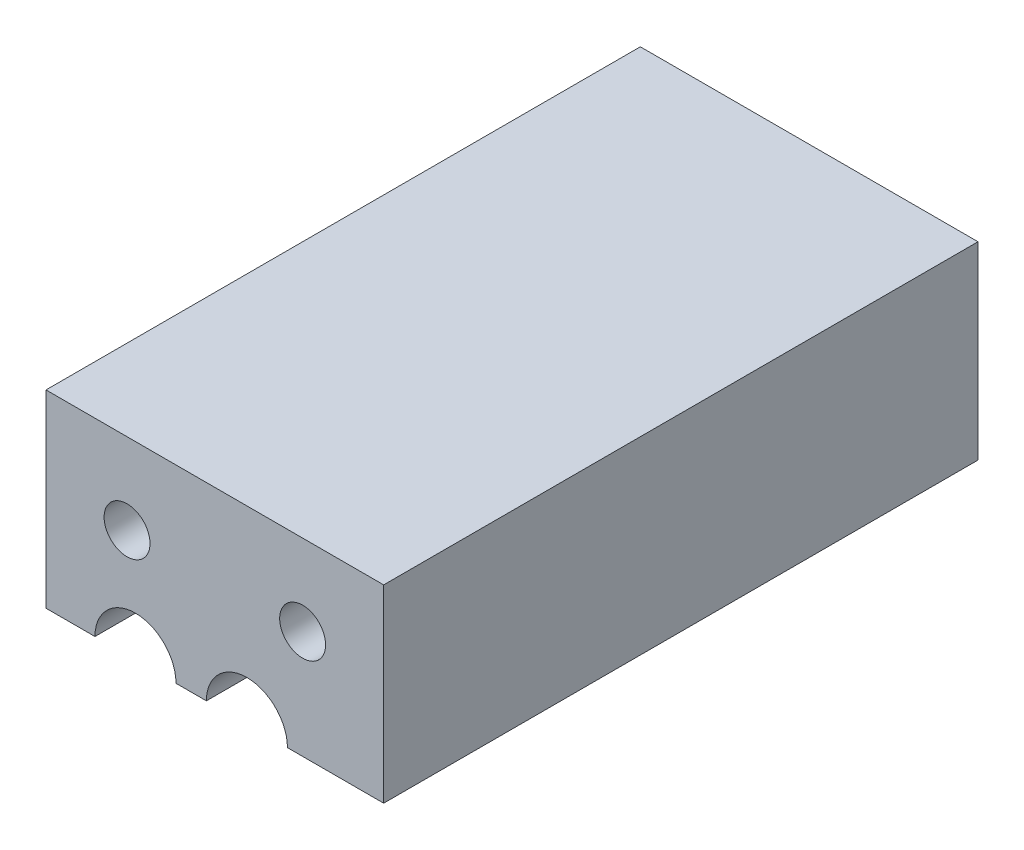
ISO-10303-21;
HEADER;
FILE_DESCRIPTION(('STEP AP214'),'2;1');
FILE_NAME('part.step','',(''),(''),'','','');
FILE_SCHEMA(('AUTOMOTIVE_DESIGN { 1 0 10303 214 1 1 1 1 }'));
ENDSEC;
DATA;
#1=APPLICATION_CONTEXT('core data for automotive mechanical design processes');
#2=APPLICATION_PROTOCOL_DEFINITION('international standard','automotive_design',2000,#1);
#3=PRODUCT_CONTEXT('',#1,'mechanical');
#4=PRODUCT('Part','Part','',(#3));
#5=PRODUCT_RELATED_PRODUCT_CATEGORY('part','',(#4));
#6=PRODUCT_DEFINITION_FORMATION('','',#4);
#7=PRODUCT_DEFINITION_CONTEXT('part definition',#1,'design');
#8=PRODUCT_DEFINITION('design','',#6,#7);
#9=PRODUCT_DEFINITION_SHAPE('','',#8);
#10=(LENGTH_UNIT() NAMED_UNIT(*) SI_UNIT(.MILLI.,.METRE.));
#11=(NAMED_UNIT(*) PLANE_ANGLE_UNIT() SI_UNIT($,.RADIAN.));
#12=(NAMED_UNIT(*) SI_UNIT($,.STERADIAN.) SOLID_ANGLE_UNIT());
#13=UNCERTAINTY_MEASURE_WITH_UNIT(LENGTH_MEASURE(1.E-05),#10,'distance_accuracy_value','');
#14=(GEOMETRIC_REPRESENTATION_CONTEXT(3) GLOBAL_UNCERTAINTY_ASSIGNED_CONTEXT((#13)) GLOBAL_UNIT_ASSIGNED_CONTEXT((#10,
#11,#12)) REPRESENTATION_CONTEXT('',''));
#15=CARTESIAN_POINT('',(0.,0.,0.));
#16=DIRECTION('',(0.,0.,1.));
#17=DIRECTION('',(1.,0.,0.));
#18=AXIS2_PLACEMENT_3D('',#15,#16,#17);
#19=CARTESIAN_POINT('',(-299.,-148.500000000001,-88.));
#20=DIRECTION('',(-1.,0.,0.));
#21=DIRECTION('',(0.,0.,1.));
#22=AXIS2_PLACEMENT_3D('',#19,#20,#21);
#23=PLANE('',#22);
#24=DIRECTION('',(0.,1.,0.));
#25=VECTOR('',#24,1.);
#26=CARTESIAN_POINT('',(-299.,-148.500000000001,0.));
#27=LINE('',#26,#25);
#28=CARTESIAN_POINT('',(-299.,-148.500000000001,0.));
#29=VERTEX_POINT('',#28);
#30=CARTESIAN_POINT('',(-299.,-120.500000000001,0.));
#31=VERTEX_POINT('',#30);
#32=EDGE_CURVE('E122',#29,#31,#27,.T.);
#33=ORIENTED_EDGE('',*,*,#32,.T.);
#34=DIRECTION('',(0.,0.,1.));
#35=VECTOR('',#34,1.);
#36=CARTESIAN_POINT('',(-299.,-120.500000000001,-88.));
#37=LINE('',#36,#35);
#38=CARTESIAN_POINT('',(-299.,-120.500000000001,-88.));
#39=VERTEX_POINT('',#38);
#40=EDGE_CURVE('E35',#39,#31,#37,.T.);
#41=ORIENTED_EDGE('',*,*,#40,.F.);
#42=DIRECTION('',(0.,1.,0.));
#43=VECTOR('',#42,1.);
#44=CARTESIAN_POINT('',(-299.,-148.500000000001,-88.));
#45=LINE('',#44,#43);
#46=CARTESIAN_POINT('',(-299.,-148.500000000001,-88.));
#47=VERTEX_POINT('',#46);
#48=EDGE_CURVE('E139',#47,#39,#45,.T.);
#49=ORIENTED_EDGE('',*,*,#48,.F.);
#50=DIRECTION('',(0.,0.,1.));
#51=VECTOR('',#50,1.);
#52=CARTESIAN_POINT('',(-299.,-148.500000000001,-88.));
#53=LINE('',#52,#51);
#54=EDGE_CURVE('E11',#47,#29,#53,.T.);
#55=ORIENTED_EDGE('',*,*,#54,.T.);
#56=EDGE_LOOP('',(#33,#41,#49,#55));
#57=FACE_BOUND('',#56,.T.);
#58=ADVANCED_FACE('F32',(#57),#23,.T.);
#59=CARTESIAN_POINT('',(-291.75,-148.500000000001,-88.));
#60=DIRECTION('',(0.,-1.,0.));
#61=DIRECTION('',(-1.,0.,0.));
#62=AXIS2_PLACEMENT_3D('',#59,#60,#61);
#63=PLANE('',#62);
#64=DIRECTION('',(-1.,0.,0.));
#65=VECTOR('',#64,1.);
#66=CARTESIAN_POINT('',(-291.75,-148.500000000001,0.));
#67=LINE('',#66,#65);
#68=CARTESIAN_POINT('',(-291.75,-148.500000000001,0.));
#69=VERTEX_POINT('',#68);
#70=EDGE_CURVE('E137',#69,#29,#67,.T.);
#71=ORIENTED_EDGE('',*,*,#70,.T.);
#72=ORIENTED_EDGE('',*,*,#54,.F.);
#73=DIRECTION('',(-1.,0.,0.));
#74=VECTOR('',#73,1.);
#75=CARTESIAN_POINT('',(-291.75,-148.500000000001,-88.));
#76=LINE('',#75,#74);
#77=CARTESIAN_POINT('',(-291.75,-148.500000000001,-88.));
#78=VERTEX_POINT('',#77);
#79=EDGE_CURVE('E48',#78,#47,#76,.T.);
#80=ORIENTED_EDGE('',*,*,#79,.F.);
#81=DIRECTION('',(0.,0.,1.));
#82=VECTOR('',#81,1.);
#83=CARTESIAN_POINT('',(-291.75,-148.500000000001,-88.));
#84=LINE('',#83,#82);
#85=EDGE_CURVE('E40',#78,#69,#84,.T.);
#86=ORIENTED_EDGE('',*,*,#85,.T.);
#87=EDGE_LOOP('',(#71,#72,#80,#86));
#88=FACE_BOUND('',#87,.T.);
#89=ADVANCED_FACE('F204',(#88),#63,.T.);
#90=CARTESIAN_POINT('',(-285.75,-148.500000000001,-88.));
#91=DIRECTION('',(0.,0.,1.));
#92=DIRECTION('',(1.,0.,0.));
#93=AXIS2_PLACEMENT_3D('',#90,#91,#92);
#94=CYLINDRICAL_SURFACE('',#93,6.00000000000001);
#95=CARTESIAN_POINT('',(-285.75,-148.500000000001,0.));
#96=DIRECTION('',(0.,0.,1.));
#97=DIRECTION('',(1.,0.,0.));
#98=AXIS2_PLACEMENT_3D('',#95,#96,#97);
#99=CIRCLE('',#98,6.00000000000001);
#100=CARTESIAN_POINT('',(-279.75,-148.500000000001,0.));
#101=VERTEX_POINT('',#100);
#102=EDGE_CURVE('E135',#101,#69,#99,.T.);
#103=ORIENTED_EDGE('',*,*,#102,.T.);
#104=ORIENTED_EDGE('',*,*,#85,.F.);
#105=CARTESIAN_POINT('',(-285.75,-148.500000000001,-88.));
#106=DIRECTION('',(0.,0.,1.));
#107=DIRECTION('',(1.,0.,0.));
#108=AXIS2_PLACEMENT_3D('',#105,#106,#107);
#109=CIRCLE('',#108,6.00000000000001);
#110=CARTESIAN_POINT('',(-279.75,-148.500000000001,-88.));
#111=VERTEX_POINT('',#110);
#112=EDGE_CURVE('E53',#111,#78,#109,.T.);
#113=ORIENTED_EDGE('',*,*,#112,.F.);
#114=DIRECTION('',(0.,0.,1.));
#115=VECTOR('',#114,1.);
#116=CARTESIAN_POINT('',(-279.75,-148.500000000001,-88.));
#117=LINE('',#116,#115);
#118=EDGE_CURVE('E155',#111,#101,#117,.T.);
#119=ORIENTED_EDGE('',*,*,#118,.T.);
#120=EDGE_LOOP('',(#103,#104,#113,#119));
#121=FACE_BOUND('',#120,.T.);
#122=ADVANCED_FACE('F202',(#121),#94,.F.);
#123=CARTESIAN_POINT('',(-275.25,-148.500000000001,-88.));
#124=DIRECTION('',(0.,-1.,0.));
#125=DIRECTION('',(-1.,0.,0.));
#126=AXIS2_PLACEMENT_3D('',#123,#124,#125);
#127=PLANE('',#126);
#128=DIRECTION('',(-1.,0.,0.));
#129=VECTOR('',#128,1.);
#130=CARTESIAN_POINT('',(-275.25,-148.500000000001,0.));
#131=LINE('',#130,#129);
#132=CARTESIAN_POINT('',(-275.25,-148.500000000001,0.));
#133=VERTEX_POINT('',#132);
#134=EDGE_CURVE('E133',#133,#101,#131,.T.);
#135=ORIENTED_EDGE('',*,*,#134,.T.);
#136=ORIENTED_EDGE('',*,*,#118,.F.);
#137=DIRECTION('',(-1.,0.,0.));
#138=VECTOR('',#137,1.);
#139=CARTESIAN_POINT('',(-275.25,-148.500000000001,-88.));
#140=LINE('',#139,#138);
#141=CARTESIAN_POINT('',(-275.25,-148.500000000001,-88.));
#142=VERTEX_POINT('',#141);
#143=EDGE_CURVE('E149',#142,#111,#140,.T.);
#144=ORIENTED_EDGE('',*,*,#143,.F.);
#145=DIRECTION('',(0.,0.,1.));
#146=VECTOR('',#145,1.);
#147=CARTESIAN_POINT('',(-275.25,-148.500000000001,-88.));
#148=LINE('',#147,#146);
#149=EDGE_CURVE('E158',#142,#133,#148,.T.);
#150=ORIENTED_EDGE('',*,*,#149,.T.);
#151=EDGE_LOOP('',(#135,#136,#144,#150));
#152=FACE_BOUND('',#151,.T.);
#153=ADVANCED_FACE('F200',(#152),#127,.T.);
#154=CARTESIAN_POINT('',(-269.25,-148.500000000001,-88.));
#155=DIRECTION('',(0.,0.,1.));
#156=DIRECTION('',(1.,0.,0.));
#157=AXIS2_PLACEMENT_3D('',#154,#155,#156);
#158=CYLINDRICAL_SURFACE('',#157,6.00000000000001);
#159=CARTESIAN_POINT('',(-269.25,-148.500000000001,0.));
#160=DIRECTION('',(0.,0.,1.));
#161=DIRECTION('',(1.,0.,0.));
#162=AXIS2_PLACEMENT_3D('',#159,#160,#161);
#163=CIRCLE('',#162,6.00000000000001);
#164=CARTESIAN_POINT('',(-263.25,-148.500000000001,0.));
#165=VERTEX_POINT('',#164);
#166=EDGE_CURVE('E131',#165,#133,#163,.T.);
#167=ORIENTED_EDGE('',*,*,#166,.T.);
#168=ORIENTED_EDGE('',*,*,#149,.F.);
#169=CARTESIAN_POINT('',(-269.25,-148.500000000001,-88.));
#170=DIRECTION('',(0.,0.,1.));
#171=DIRECTION('',(1.,0.,0.));
#172=AXIS2_PLACEMENT_3D('',#169,#170,#171);
#173=CIRCLE('',#172,6.00000000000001);
#174=CARTESIAN_POINT('',(-263.25,-148.500000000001,-88.));
#175=VERTEX_POINT('',#174);
#176=EDGE_CURVE('E147',#175,#142,#173,.T.);
#177=ORIENTED_EDGE('',*,*,#176,.F.);
#178=DIRECTION('',(0.,0.,1.));
#179=VECTOR('',#178,1.);
#180=CARTESIAN_POINT('',(-263.25,-148.500000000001,-88.));
#181=LINE('',#180,#179);
#182=EDGE_CURVE('E161',#175,#165,#181,.T.);
#183=ORIENTED_EDGE('',*,*,#182,.T.);
#184=EDGE_LOOP('',(#167,#168,#177,#183));
#185=FACE_BOUND('',#184,.T.);
#186=ADVANCED_FACE('F197',(#185),#158,.F.);
#187=CARTESIAN_POINT('',(-249.,-148.500000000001,-88.));
#188=DIRECTION('',(0.,-1.,0.));
#189=DIRECTION('',(-1.,0.,0.));
#190=AXIS2_PLACEMENT_3D('',#187,#188,#189);
#191=PLANE('',#190);
#192=DIRECTION('',(-1.,0.,0.));
#193=VECTOR('',#192,1.);
#194=CARTESIAN_POINT('',(-249.,-148.500000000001,0.));
#195=LINE('',#194,#193);
#196=CARTESIAN_POINT('',(-249.,-148.500000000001,0.));
#197=VERTEX_POINT('',#196);
#198=EDGE_CURVE('E129',#197,#165,#195,.T.);
#199=ORIENTED_EDGE('',*,*,#198,.T.);
#200=ORIENTED_EDGE('',*,*,#182,.F.);
#201=DIRECTION('',(-1.,0.,0.));
#202=VECTOR('',#201,1.);
#203=CARTESIAN_POINT('',(-249.,-148.500000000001,-88.));
#204=LINE('',#203,#202);
#205=CARTESIAN_POINT('',(-249.,-148.500000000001,-88.));
#206=VERTEX_POINT('',#205);
#207=EDGE_CURVE('E145',#206,#175,#204,.T.);
#208=ORIENTED_EDGE('',*,*,#207,.F.);
#209=DIRECTION('',(0.,0.,1.));
#210=VECTOR('',#209,1.);
#211=CARTESIAN_POINT('',(-249.,-148.500000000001,-88.));
#212=LINE('',#211,#210);
#213=EDGE_CURVE('E164',#206,#197,#212,.T.);
#214=ORIENTED_EDGE('',*,*,#213,.T.);
#215=EDGE_LOOP('',(#199,#200,#208,#214));
#216=FACE_BOUND('',#215,.T.);
#217=ADVANCED_FACE('F189',(#216),#191,.T.);
#218=CARTESIAN_POINT('',(-249.,-120.500000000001,-88.));
#219=DIRECTION('',(1.,0.,0.));
#220=DIRECTION('',(0.,0.,-1.));
#221=AXIS2_PLACEMENT_3D('',#218,#219,#220);
#222=PLANE('',#221);
#223=DIRECTION('',(0.,-1.,0.));
#224=VECTOR('',#223,1.);
#225=CARTESIAN_POINT('',(-249.,-120.500000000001,0.));
#226=LINE('',#225,#224);
#227=CARTESIAN_POINT('',(-249.,-120.500000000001,0.));
#228=VERTEX_POINT('',#227);
#229=EDGE_CURVE('E127',#228,#197,#226,.T.);
#230=ORIENTED_EDGE('',*,*,#229,.T.);
#231=ORIENTED_EDGE('',*,*,#213,.F.);
#232=DIRECTION('',(0.,-1.,0.));
#233=VECTOR('',#232,1.);
#234=CARTESIAN_POINT('',(-249.,-120.500000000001,-88.));
#235=LINE('',#234,#233);
#236=CARTESIAN_POINT('',(-249.,-120.500000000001,-88.));
#237=VERTEX_POINT('',#236);
#238=EDGE_CURVE('E143',#237,#206,#235,.T.);
#239=ORIENTED_EDGE('',*,*,#238,.F.);
#240=DIRECTION('',(0.,0.,1.));
#241=VECTOR('',#240,1.);
#242=CARTESIAN_POINT('',(-249.,-120.500000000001,-88.));
#243=LINE('',#242,#241);
#244=EDGE_CURVE('E166',#237,#228,#243,.T.);
#245=ORIENTED_EDGE('',*,*,#244,.T.);
#246=EDGE_LOOP('',(#230,#231,#239,#245));
#247=FACE_BOUND('',#246,.T.);
#248=ADVANCED_FACE('F186',(#247),#222,.T.);
#249=CARTESIAN_POINT('',(-299.,-120.500000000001,-88.));
#250=DIRECTION('',(0.,1.,0.));
#251=DIRECTION('',(1.,0.,0.));
#252=AXIS2_PLACEMENT_3D('',#249,#250,#251);
#253=PLANE('',#252);
#254=DIRECTION('',(1.,0.,0.));
#255=VECTOR('',#254,1.);
#256=CARTESIAN_POINT('',(-299.,-120.500000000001,0.));
#257=LINE('',#256,#255);
#258=EDGE_CURVE('E125',#31,#228,#257,.T.);
#259=ORIENTED_EDGE('',*,*,#258,.T.);
#260=ORIENTED_EDGE('',*,*,#244,.F.);
#261=DIRECTION('',(1.,0.,0.));
#262=VECTOR('',#261,1.);
#263=CARTESIAN_POINT('',(-299.,-120.500000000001,-88.));
#264=LINE('',#263,#262);
#265=EDGE_CURVE('E141',#39,#237,#264,.T.);
#266=ORIENTED_EDGE('',*,*,#265,.F.);
#267=ORIENTED_EDGE('',*,*,#40,.T.);
#268=EDGE_LOOP('',(#259,#260,#266,#267));
#269=FACE_BOUND('',#268,.T.);
#270=ADVANCED_FACE('F175',(#269),#253,.T.);
#271=CARTESIAN_POINT('',(-269.25,-148.500000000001,-88.));
#272=DIRECTION('',(0.,0.,1.));
#273=DIRECTION('',(1.,0.,0.));
#274=AXIS2_PLACEMENT_3D('',#271,#272,#273);
#275=PLANE('',#274);
#276=ORIENTED_EDGE('',*,*,#48,.T.);
#277=ORIENTED_EDGE('',*,*,#265,.T.);
#278=ORIENTED_EDGE('',*,*,#238,.T.);
#279=ORIENTED_EDGE('',*,*,#207,.T.);
#280=ORIENTED_EDGE('',*,*,#176,.T.);
#281=ORIENTED_EDGE('',*,*,#143,.T.);
#282=ORIENTED_EDGE('',*,*,#112,.T.);
#283=ORIENTED_EDGE('',*,*,#79,.T.);
#284=EDGE_LOOP('',(#276,#277,#278,#279,#280,#281,#282,#283));
#285=FACE_BOUND('',#284,.T.);
#286=ADVANCED_FACE('F192',(#285),#275,.F.);
#287=CARTESIAN_POINT('',(-269.25,-148.500000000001,0.));
#288=DIRECTION('',(0.,0.,1.));
#289=DIRECTION('',(1.,0.,0.));
#290=AXIS2_PLACEMENT_3D('',#287,#288,#289);
#291=PLANE('',#290);
#292=CARTESIAN_POINT('',(-261.,-132.500000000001,0.));
#293=DIRECTION('',(0.,0.,-1.));
#294=DIRECTION('',(1.,0.,0.));
#295=AXIS2_PLACEMENT_3D('',#292,#293,#294);
#296=CIRCLE('',#295,3.40000000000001);
#297=CARTESIAN_POINT('',(-257.6,-132.500000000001,0.));
#298=VERTEX_POINT('',#297);
#299=EDGE_CURVE('E111',#298,#298,#296,.T.);
#300=ORIENTED_EDGE('',*,*,#299,.T.);
#301=EDGE_LOOP('',(#300));
#302=FACE_BOUND('',#301,.T.);
#303=CARTESIAN_POINT('',(-287.,-132.500000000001,0.));
#304=DIRECTION('',(0.,0.,-1.));
#305=DIRECTION('',(1.,0.,0.));
#306=AXIS2_PLACEMENT_3D('',#303,#304,#305);
#307=CIRCLE('',#306,3.40000000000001);
#308=CARTESIAN_POINT('',(-283.6,-132.500000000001,0.));
#309=VERTEX_POINT('',#308);
#310=EDGE_CURVE('E119',#309,#309,#307,.T.);
#311=ORIENTED_EDGE('',*,*,#310,.T.);
#312=EDGE_LOOP('',(#311));
#313=FACE_BOUND('',#312,.T.);
#314=ORIENTED_EDGE('',*,*,#32,.F.);
#315=ORIENTED_EDGE('',*,*,#70,.F.);
#316=ORIENTED_EDGE('',*,*,#102,.F.);
#317=ORIENTED_EDGE('',*,*,#134,.F.);
#318=ORIENTED_EDGE('',*,*,#166,.F.);
#319=ORIENTED_EDGE('',*,*,#198,.F.);
#320=ORIENTED_EDGE('',*,*,#229,.F.);
#321=ORIENTED_EDGE('',*,*,#258,.F.);
#322=EDGE_LOOP('',(#314,#315,#316,#317,#318,#319,#320,#321));
#323=FACE_BOUND('',#322,.T.);
#324=ADVANCED_FACE('F181',(#302,#313,#323),#291,.T.);
#325=CARTESIAN_POINT('',(-287.,-132.500000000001,0.));
#326=DIRECTION('',(0.,0.,1.));
#327=DIRECTION('',(1.,0.,0.));
#328=AXIS2_PLACEMENT_3D('',#325,#326,#327);
#329=CYLINDRICAL_SURFACE('',#328,3.40000000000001);
#330=CARTESIAN_POINT('',(-287.,-132.500000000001,-30.));
#331=DIRECTION('',(0.,0.,-1.));
#332=DIRECTION('',(1.,0.,0.));
#333=AXIS2_PLACEMENT_3D('',#330,#331,#332);
#334=CIRCLE('',#333,3.40000000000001);
#335=CARTESIAN_POINT('',(-283.6,-132.500000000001,-30.));
#336=VERTEX_POINT('',#335);
#337=EDGE_CURVE('E114',#336,#336,#334,.T.);
#338=ORIENTED_EDGE('',*,*,#337,.T.);
#339=EDGE_LOOP('',(#338));
#340=FACE_BOUND('',#339,.T.);
#341=ORIENTED_EDGE('',*,*,#310,.F.);
#342=EDGE_LOOP('',(#341));
#343=FACE_BOUND('',#342,.T.);
#344=ADVANCED_FACE('F229',(#340,#343),#329,.F.);
#345=CARTESIAN_POINT('',(-287.,-132.500000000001,-30.));
#346=DIRECTION('',(0.,0.,1.));
#347=DIRECTION('',(1.,0.,0.));
#348=AXIS2_PLACEMENT_3D('',#345,#346,#347);
#349=CONICAL_SURFACE('',#348,3.40000000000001,1.02974425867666);
#350=CARTESIAN_POINT('',(-287.,-132.500000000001,-32.0429261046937));
#351=VERTEX_POINT('',#350);
#352=VERTEX_LOOP('',#351);
#353=FACE_BOUND('',#352,.T.);
#354=ORIENTED_EDGE('',*,*,#337,.F.);
#355=EDGE_LOOP('',(#354));
#356=FACE_BOUND('',#355,.T.);
#357=ADVANCED_FACE('F234',(#353,#356),#349,.F.);
#358=CARTESIAN_POINT('',(-261.,-132.500000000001,0.));
#359=DIRECTION('',(0.,0.,1.));
#360=DIRECTION('',(1.,0.,0.));
#361=AXIS2_PLACEMENT_3D('',#358,#359,#360);
#362=CYLINDRICAL_SURFACE('',#361,3.40000000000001);
#363=CARTESIAN_POINT('',(-261.,-132.500000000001,-30.));
#364=DIRECTION('',(0.,0.,-1.));
#365=DIRECTION('',(1.,0.,0.));
#366=AXIS2_PLACEMENT_3D('',#363,#364,#365);
#367=CIRCLE('',#366,3.40000000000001);
#368=CARTESIAN_POINT('',(-257.6,-132.500000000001,-30.));
#369=VERTEX_POINT('',#368);
#370=EDGE_CURVE('E109',#369,#369,#367,.T.);
#371=ORIENTED_EDGE('',*,*,#370,.T.);
#372=EDGE_LOOP('',(#371));
#373=FACE_BOUND('',#372,.T.);
#374=ORIENTED_EDGE('',*,*,#299,.F.);
#375=EDGE_LOOP('',(#374));
#376=FACE_BOUND('',#375,.T.);
#377=ADVANCED_FACE('F105',(#373,#376),#362,.F.);
#378=CARTESIAN_POINT('',(-261.,-132.500000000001,-30.));
#379=DIRECTION('',(0.,0.,1.));
#380=DIRECTION('',(1.,0.,0.));
#381=AXIS2_PLACEMENT_3D('',#378,#379,#380);
#382=CONICAL_SURFACE('',#381,3.40000000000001,1.02974425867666);
#383=CARTESIAN_POINT('',(-261.,-132.500000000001,-32.0429261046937));
#384=VERTEX_POINT('',#383);
#385=VERTEX_LOOP('',#384);
#386=FACE_BOUND('',#385,.T.);
#387=ORIENTED_EDGE('',*,*,#370,.F.);
#388=EDGE_LOOP('',(#387));
#389=FACE_BOUND('',#388,.T.);
#390=ADVANCED_FACE('F102',(#386,#389),#382,.F.);
#391=CLOSED_SHELL('',(#58,#89,#122,#153,#186,#217,#248,#270,#286,#324,#344,#357,#377,#390));
#392=MANIFOLD_SOLID_BREP('B2',#391);
#393=ADVANCED_BREP_SHAPE_REPRESENTATION('',(#18,#392),#14);
#394=SHAPE_DEFINITION_REPRESENTATION(#9,#393);
ENDSEC;
END-ISO-10303-21;
